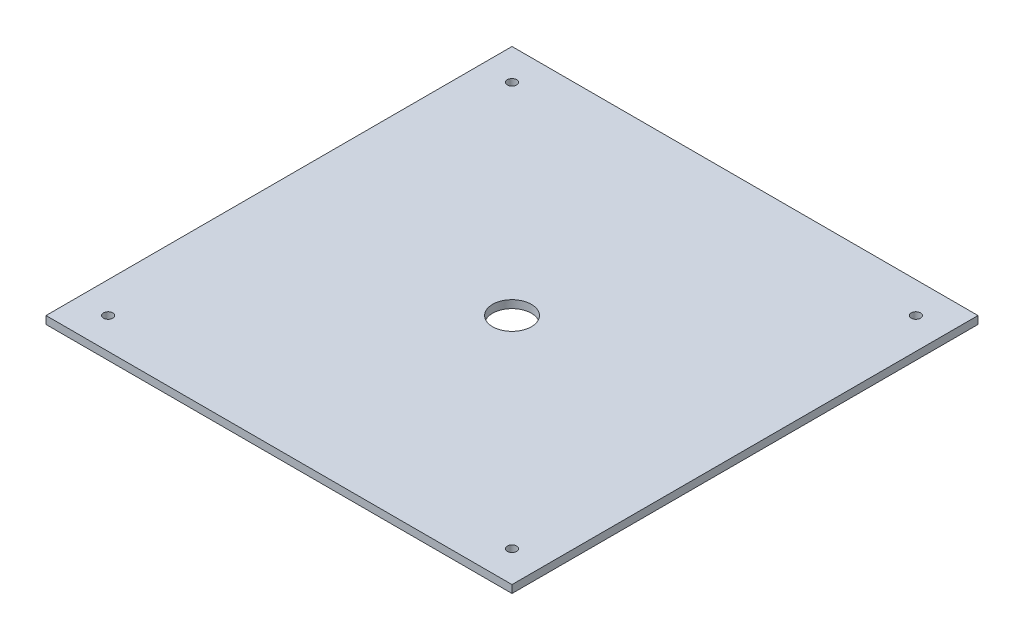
from build123d import *

# Parameters (mm, degrees)
SKETCH1_W           = 300
SKETCH1_H           = 300
BOSS_EXTRUDE1_DEPTH = 5
SKETCH2_R           = 3
CUT_EXTRUDE1_DEPTH  = 5
SKETCH3_R           = 12.5
CUT_EXTRUDE2_DEPTH  = 5


with BuildPart() as part:
    # Sketch1 → Boss-Extrude1 (new body)
    with BuildSketch(Plane(origin=(0, 0, 0), x_dir=(1, 0, 0), z_dir=(0, 1, 0))):
        with Locations((150, 150)):
            Rectangle(SKETCH1_W, SKETCH1_H)
    extrude(amount=BOSS_EXTRUDE1_DEPTH)

    # Sketch2 → Cut-Extrude1 (cut)
    with BuildSketch(Plane(origin=(0, 5, 0), x_dir=(1, 0, 0), z_dir=(0, 1, 0))):
        with Locations(Location((20, 280, 0), (0, 0, 270))):
            Circle(SKETCH2_R)
        with Locations(Location((20, 20, 0), (0, 0, 90))):
            Circle(SKETCH2_R)
        with Locations(Location((280, 20, 0), (0, 0, 270))):
            Circle(SKETCH2_R)
        with Locations(Location((280, 280, 0), (0, 0, 90))):
            Circle(SKETCH2_R)
    extrude(amount=-CUT_EXTRUDE1_DEPTH, mode=Mode.SUBTRACT)

    # Sketch3 → Cut-Extrude2 (cut)
    with BuildSketch(Plane(origin=(0, 5, 0), x_dir=(1, 0, 0), z_dir=(0, 1, 0))):
        with Locations(Location((150, 150, 0), (0, 0, 270))):
            Circle(SKETCH3_R)
    extrude(amount=-CUT_EXTRUDE2_DEPTH, mode=Mode.SUBTRACT)


solid = part.part
